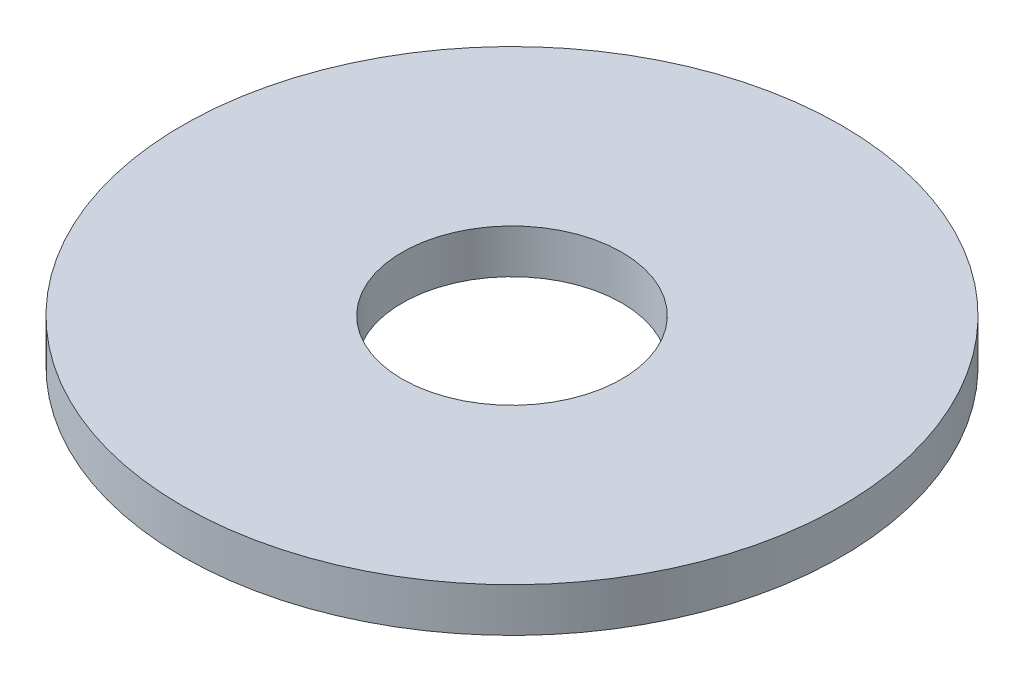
from build123d import *

# Parameters (mm, degrees)
SKETCH1_R           = 9.525
SKETCH1_R_2         = 3.175
BOSS_EXTRUDE1_DEPTH = 1.27


with BuildPart() as part:
    # Sketch1 → Boss-Extrude1 (new body)
    with BuildSketch(Plane(origin=(0, 0, 0), x_dir=(1, 0, 0), z_dir=(0, 1, 0))):
        with Locations(Location((0, 0, 0), (0, 0, 270))):
            Circle(SKETCH1_R)
        with Locations(Location((0, 0, 0), (0, 0, 270))):
            Circle(SKETCH1_R_2, mode=Mode.SUBTRACT)
    extrude(amount=BOSS_EXTRUDE1_DEPTH)


solid = part.part
